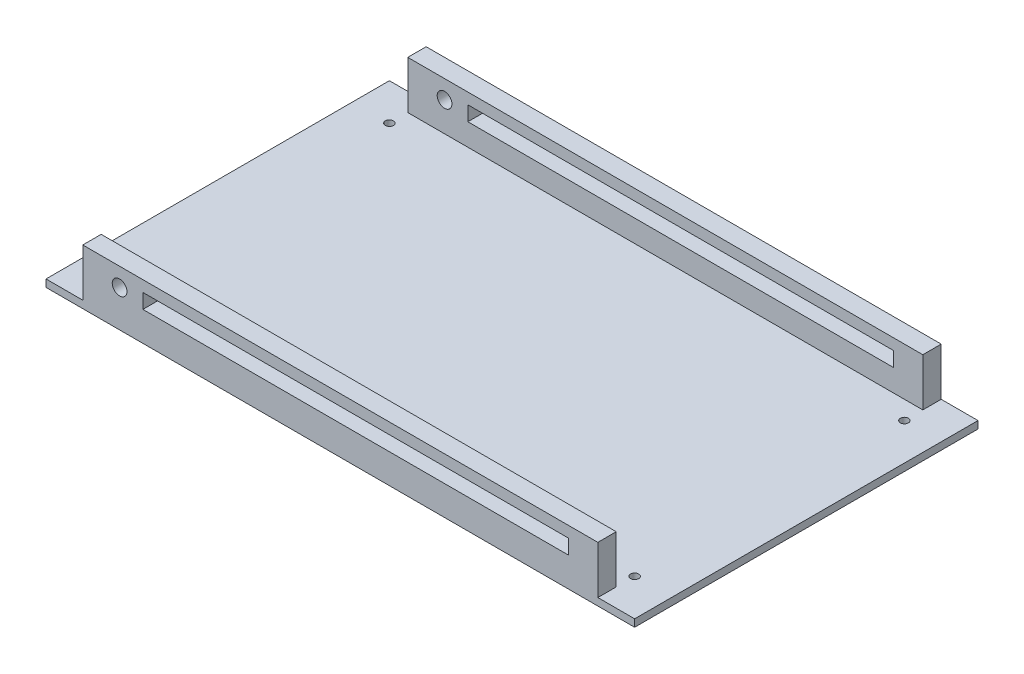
from build123d import *

# Parameters (mm, degrees)
SKETCH_1_W                           = 480
SKETCH_1_H                           = 6
MOUNT_PLATE_480X280X6_DEPTH          = 140
SKETCH_2_W                           = 420
SKETCH_2_H                           = 39
GUIDE_RAILS_BLANK_DEPTH              = 140
SKETCH_3_W                           = 430
SKETCH_3_H                           = 40
OPEN_CENTRE_ABOVE_MOUNT_DEPTH        = 125
SKETCH_4_R                           = 6
FIXED_PIVOT_D12_XMINUS180_DEPTH      = 500
SKETCH_5_W                           = 347
SKETCH_5_H                           = 12
SLIDING_GUIDE_12X347_DEPTH           = 500
SKETCH_6_R                           = 3.3
FOUR_M6_CLEARANCE_D6P6_420X220_DEPTH = 50


with BuildPart() as part:
    # Sketch 1 → Mount_Plate_480x280x6 (new, symmetric)
    with BuildSketch(Plane.XY):
        with Locations((0, 23)):
            Rectangle(SKETCH_1_W, SKETCH_1_H)
    extrude(amount=MOUNT_PLATE_480X280X6_DEPTH, both=True)

    # Sketch 2 → Guide_Rails_Blank (add, symmetric)
    with BuildSketch(Plane.XY):
        with Locations((0, 45.5)):
            Rectangle(SKETCH_2_W, SKETCH_2_H)
    extrude(amount=GUIDE_RAILS_BLANK_DEPTH, both=True)

    # Sketch 3 → Open_Centre_Above_Mount (cut, symmetric)
    with BuildSketch(Plane.XY):
        with Locations((0, 46)):
            Rectangle(SKETCH_3_W, SKETCH_3_H)
    extrude(amount=OPEN_CENTRE_ABOVE_MOUNT_DEPTH, both=True, mode=Mode.SUBTRACT)

    # Sketch 4 → Fixed_Pivot_D12_Xminus180 (cut, symmetric)
    with BuildSketch(Plane.XY):
        with Locations(Location((-180, 50, 0), (0, 0, 180))):
            Circle(SKETCH_4_R)
    extrude(amount=FIXED_PIVOT_D12_XMINUS180_DEPTH, both=True, mode=Mode.SUBTRACT)

    # Sketch 5 → Sliding_Guide_12x347 (cut, symmetric)
    with BuildSketch(Plane.XY):
        with Locations((12.5, 50)):
            Rectangle(SKETCH_5_W, SKETCH_5_H)
    extrude(amount=SLIDING_GUIDE_12X347_DEPTH, both=True, mode=Mode.SUBTRACT)

    # Sketch 6 → Four_M6_Clearance_D6p6_420x220 (cut, symmetric)
    with BuildSketch(Plane(origin=(0, 0, 0), x_dir=(1, 0, 0), z_dir=(0, 1, 0))):
        with Locations(Location((-210, -110, 0), (0, 0, 270))):
            Circle(SKETCH_6_R)
        with Locations(Location((-210, 110, 0), (0, 0, 270))):
            Circle(SKETCH_6_R)
        with Locations(Location((210, -110, 0), (0, 0, 270))):
            Circle(SKETCH_6_R)
        with Locations(Location((210, 110, 0), (0, 0, 270))):
            Circle(SKETCH_6_R)
    extrude(amount=FOUR_M6_CLEARANCE_D6P6_420X220_DEPTH, both=True, mode=Mode.SUBTRACT)


solid = part.part
